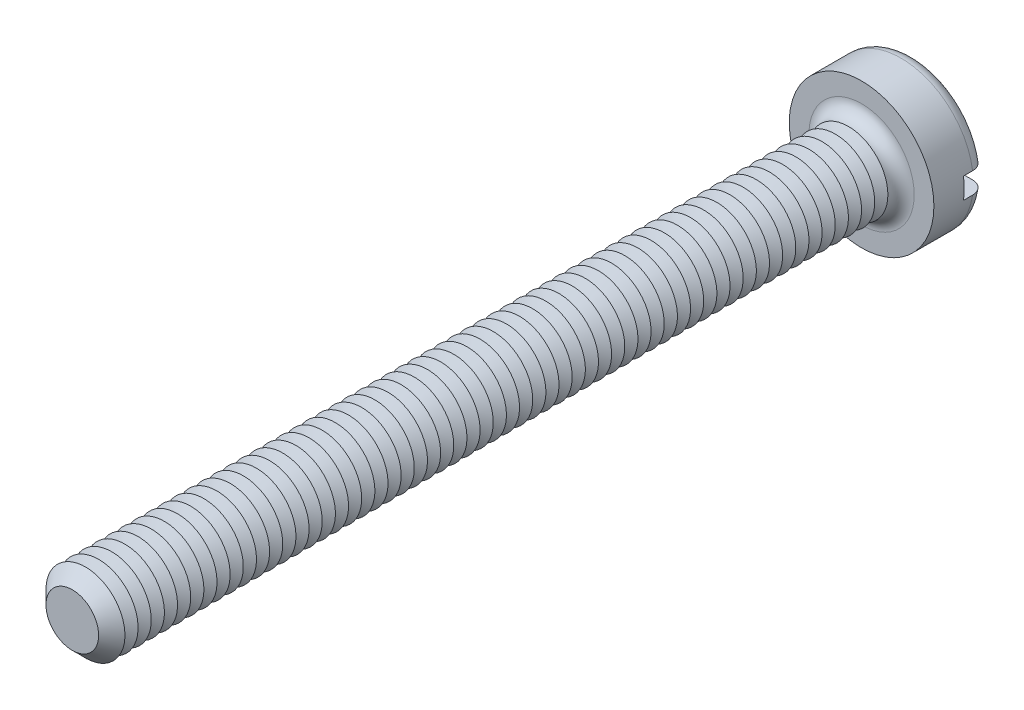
from build123d import *

# Parameters (mm, degrees)
SKETCH3_R           = 2.75
BOSS_EXTRUDE2_DEPTH = 2
SKETCH4_R           = 1.5
BOSS_EXTRUDE3_DEPTH = 30
FILLET1_R           = 0.5
CHAMFER1_SIZE       = 0.5
LPATTERN1_COUNT     = 58
LPATTERN1_PITCH     = 0.5
SKETCH8_W           = 5.5
SKETCH8_H           = 0.8
CUT_EXTRUDE1_DEPTH  = 0.85


with BuildPart() as part:
    # Sketch3 → Boss-Extrude2 (new body)
    with BuildSketch(Plane.XY):
        Circle(SKETCH3_R)
    extrude(amount=-BOSS_EXTRUDE2_DEPTH)

    # Sketch4 → Boss-Extrude3 (add)
    with BuildSketch(Plane.XY):
        Circle(SKETCH4_R)
    extrude(amount=BOSS_EXTRUDE3_DEPTH)

    # Fillet1
    fillet1_edges = [part.edges().sort_by_distance(p)[0] for p in [
        (-2.75, 0, -2),
        (-1.5, 0, 0),
    ]]
    fillet(fillet1_edges, radius=FILLET1_R)

    # Chamfer1
    chamfer1_edges = [part.edges().sort_by_distance(p)[0] for p in [
        (-1.5, 0, 30),
    ]]
    chamfer(chamfer1_edges, length=CHAMFER1_SIZE)

    # Sketch6 → Cut-Revolve1 (revolve, cut)
    with BuildSketch(Plane(origin=(0, 0, 0), x_dir=(0, 0, -1), z_dir=(1, 0, 0)), mode=Mode.PRIVATE) as cut_revolve1_sk:
        Polygon((-0.5, 1.5), (-0.75, 1.066987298), (-1, 1.5), align=None)
    cut_revolve1 = revolve(cut_revolve1_sk.sketch.rotate(Axis((0, 0, -1.694361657), (0, 0, 1)), 90), axis=Axis((0, 0, -1.694361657), (0, 0, 1)), mode=Mode.SUBTRACT)

    # LPattern1: Cut-Revolve1 ×58
    with Locations(*[(0, 0, i * LPATTERN1_PITCH) for i in range(1, LPATTERN1_COUNT)]):
        add(cut_revolve1, mode=Mode.SUBTRACT)

    # Sketch8 → Cut-Extrude1 (cut)
    with BuildSketch(Plane(origin=(0, 0, -2), x_dir=(-1, 0, 0), z_dir=(0, 0, -1))):
        Rectangle(SKETCH8_W, SKETCH8_H)
    extrude(amount=-CUT_EXTRUDE1_DEPTH, mode=Mode.SUBTRACT)


solid = part.part
